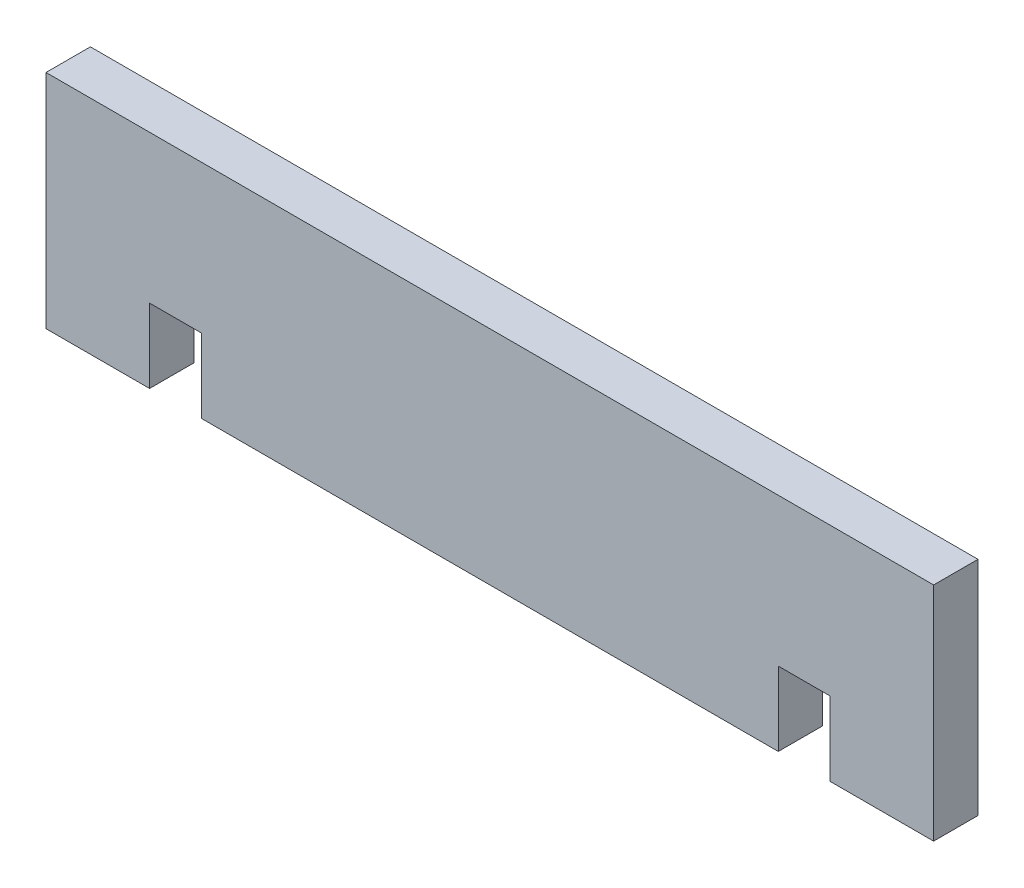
from build123d import *

# Parameters (mm, degrees)
ESQUISSE1_W             = 60
ESQUISSE1_H             = 15
EXTRUSION1_DEPTH        = 3
ESQUISSE2_W             = 3.5
ESQUISSE2_H             = 5
ENL_V_MAT_EXTRU_1_DEPTH = 3


with BuildPart() as part:
    # Esquisse1 → Extrusion1 (new body)
    with BuildSketch(Plane.XY):
        with Locations((30, 7.5)):
            Rectangle(ESQUISSE1_W, ESQUISSE1_H)
    extrude(amount=EXTRUSION1_DEPTH)

    # Esquisse2 → Enl_v. mat.-Extru.1 (cut)
    with BuildSketch(Plane.XY.offset(3)):
        with Locations((8.75, 2.5)):
            Rectangle(ESQUISSE2_W, ESQUISSE2_H)
        with Locations((51.25, 2.5)):
            Rectangle(ESQUISSE2_W, ESQUISSE2_H)
    extrude(amount=-ENL_V_MAT_EXTRU_1_DEPTH, mode=Mode.SUBTRACT)


solid = part.part
